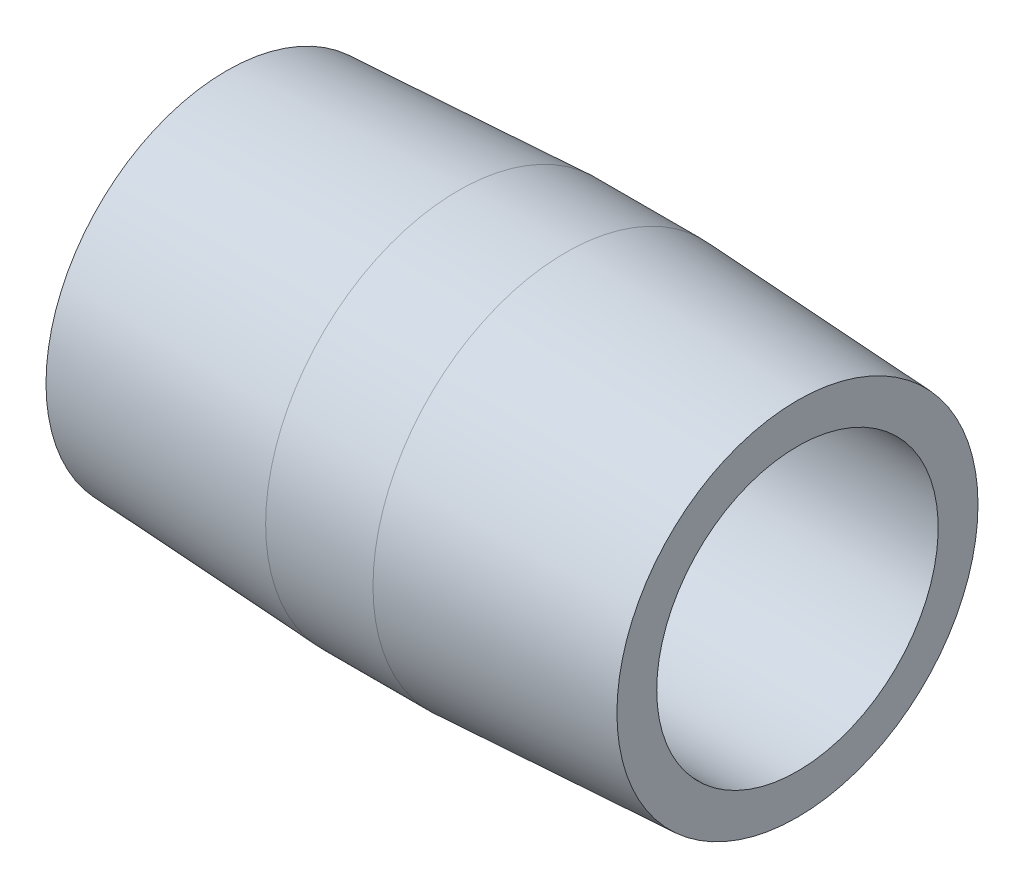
ISO-10303-21;
HEADER;
FILE_DESCRIPTION(('STEP AP214'),'2;1');
FILE_NAME('part.step','',(''),(''),'','','');
FILE_SCHEMA(('AUTOMOTIVE_DESIGN { 1 0 10303 214 1 1 1 1 }'));
ENDSEC;
DATA;
#1=APPLICATION_CONTEXT('core data for automotive mechanical design processes');
#2=APPLICATION_PROTOCOL_DEFINITION('international standard','automotive_design',2000,#1);
#3=PRODUCT_CONTEXT('',#1,'mechanical');
#4=PRODUCT('Part','Part','',(#3));
#5=PRODUCT_RELATED_PRODUCT_CATEGORY('part','',(#4));
#6=PRODUCT_DEFINITION_FORMATION('','',#4);
#7=PRODUCT_DEFINITION_CONTEXT('part definition',#1,'design');
#8=PRODUCT_DEFINITION('design','',#6,#7);
#9=PRODUCT_DEFINITION_SHAPE('','',#8);
#10=(LENGTH_UNIT() NAMED_UNIT(*) SI_UNIT(.MILLI.,.METRE.));
#11=(NAMED_UNIT(*) PLANE_ANGLE_UNIT() SI_UNIT($,.RADIAN.));
#12=(NAMED_UNIT(*) SI_UNIT($,.STERADIAN.) SOLID_ANGLE_UNIT());
#13=UNCERTAINTY_MEASURE_WITH_UNIT(LENGTH_MEASURE(1.E-05),#10,'distance_accuracy_value','');
#14=(GEOMETRIC_REPRESENTATION_CONTEXT(3) GLOBAL_UNCERTAINTY_ASSIGNED_CONTEXT((#13)) GLOBAL_UNIT_ASSIGNED_CONTEXT((#10,
#11,#12)) REPRESENTATION_CONTEXT('',''));
#15=CARTESIAN_POINT('',(0.,0.,0.));
#16=DIRECTION('',(0.,0.,1.));
#17=DIRECTION('',(1.,0.,0.));
#18=AXIS2_PLACEMENT_3D('',#15,#16,#17);
#19=CARTESIAN_POINT('',(25.4,6.26110000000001,0.));
#20=DIRECTION('',(-1.,0.,0.));
#21=DIRECTION('',(0.,0.,1.));
#22=AXIS2_PLACEMENT_3D('',#19,#20,#21);
#23=PLANE('',#22);
#24=CARTESIAN_POINT('',(25.4,0.,0.));
#25=DIRECTION('',(-1.,0.,0.));
#26=DIRECTION('',(0.,0.,1.));
#27=AXIS2_PLACEMENT_3D('',#24,#25,#26);
#28=CIRCLE('',#27,8.03205001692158);
#29=CARTESIAN_POINT('',(25.4,0.,8.03205001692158));
#30=VERTEX_POINT('',#29);
#31=EDGE_CURVE('E10',#30,#30,#28,.T.);
#32=ORIENTED_EDGE('',*,*,#31,.F.);
#33=EDGE_LOOP('',(#32));
#34=FACE_BOUND('',#33,.T.);
#35=CARTESIAN_POINT('',(25.4,0.,0.));
#36=DIRECTION('',(-1.,0.,0.));
#37=DIRECTION('',(0.,0.,1.));
#38=AXIS2_PLACEMENT_3D('',#35,#36,#37);
#39=CIRCLE('',#38,6.26110000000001);
#40=CARTESIAN_POINT('',(25.4,0.,6.26110000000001));
#41=VERTEX_POINT('',#40);
#42=EDGE_CURVE('E52',#41,#41,#39,.T.);
#43=ORIENTED_EDGE('',*,*,#42,.T.);
#44=EDGE_LOOP('',(#43));
#45=FACE_BOUND('',#44,.T.);
#46=ADVANCED_FACE('F30',(#34,#45),#23,.F.);
#47=CARTESIAN_POINT('',(25.4,0.,0.));
#48=DIRECTION('',(-1.,0.,0.));
#49=DIRECTION('',(0.,0.,1.));
#50=AXIS2_PLACEMENT_3D('',#47,#48,#49);
#51=CONICAL_SURFACE('',#50,8.03205001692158,0.0523598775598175);
#52=CARTESIAN_POINT('',(15.0876,0.,0.));
#53=DIRECTION('',(-1.,0.,0.));
#54=DIRECTION('',(0.,0.,1.));
#55=AXIS2_PLACEMENT_3D('',#52,#53,#54);
#56=CIRCLE('',#55,8.57249999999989);
#57=CARTESIAN_POINT('',(15.0876,0.,8.57249999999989));
#58=VERTEX_POINT('',#57);
#59=EDGE_CURVE('E36',#58,#58,#56,.T.);
#60=ORIENTED_EDGE('',*,*,#59,.F.);
#61=EDGE_LOOP('',(#60));
#62=FACE_BOUND('',#61,.T.);
#63=ORIENTED_EDGE('',*,*,#31,.T.);
#64=EDGE_LOOP('',(#63));
#65=FACE_BOUND('',#64,.T.);
#66=ADVANCED_FACE('F77',(#62,#65),#51,.T.);
#67=CARTESIAN_POINT('',(0.,0.,0.));
#68=DIRECTION('',(-1.,0.,0.));
#69=DIRECTION('',(0.,0.,1.));
#70=AXIS2_PLACEMENT_3D('',#67,#68,#69);
#71=CYLINDRICAL_SURFACE('',#70,8.57249999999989);
#72=CARTESIAN_POINT('',(10.3124,0.,0.));
#73=DIRECTION('',(-1.,0.,0.));
#74=DIRECTION('',(0.,0.,1.));
#75=AXIS2_PLACEMENT_3D('',#72,#73,#74);
#76=CIRCLE('',#75,8.57249999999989);
#77=CARTESIAN_POINT('',(10.3124,0.,8.57249999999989));
#78=VERTEX_POINT('',#77);
#79=EDGE_CURVE('E40',#78,#78,#76,.T.);
#80=ORIENTED_EDGE('',*,*,#79,.F.);
#81=EDGE_LOOP('',(#80));
#82=FACE_BOUND('',#81,.T.);
#83=ORIENTED_EDGE('',*,*,#59,.T.);
#84=EDGE_LOOP('',(#83));
#85=FACE_BOUND('',#84,.T.);
#86=ADVANCED_FACE('F72',(#82,#85),#71,.T.);
#87=CARTESIAN_POINT('',(10.3124,0.,0.));
#88=DIRECTION('',(1.,0.,0.));
#89=DIRECTION('',(0.,0.,-1.));
#90=AXIS2_PLACEMENT_3D('',#87,#88,#89);
#91=CONICAL_SURFACE('',#90,8.57249999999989,0.0523598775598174);
#92=CARTESIAN_POINT('',(0.,0.,0.));
#93=DIRECTION('',(-1.,0.,0.));
#94=DIRECTION('',(0.,0.,1.));
#95=AXIS2_PLACEMENT_3D('',#92,#93,#94);
#96=CIRCLE('',#95,8.03205001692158);
#97=CARTESIAN_POINT('',(0.,0.,8.03205001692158));
#98=VERTEX_POINT('',#97);
#99=EDGE_CURVE('E44',#98,#98,#96,.T.);
#100=ORIENTED_EDGE('',*,*,#99,.F.);
#101=EDGE_LOOP('',(#100));
#102=FACE_BOUND('',#101,.T.);
#103=ORIENTED_EDGE('',*,*,#79,.T.);
#104=EDGE_LOOP('',(#103));
#105=FACE_BOUND('',#104,.T.);
#106=ADVANCED_FACE('F66',(#102,#105),#91,.T.);
#107=CARTESIAN_POINT('',(0.,6.26110000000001,0.));
#108=DIRECTION('',(1.,0.,0.));
#109=DIRECTION('',(0.,0.,-1.));
#110=AXIS2_PLACEMENT_3D('',#107,#108,#109);
#111=PLANE('',#110);
#112=CARTESIAN_POINT('',(0.,0.,0.));
#113=DIRECTION('',(-1.,0.,0.));
#114=DIRECTION('',(0.,0.,1.));
#115=AXIS2_PLACEMENT_3D('',#112,#113,#114);
#116=CIRCLE('',#115,6.26110000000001);
#117=CARTESIAN_POINT('',(0.,0.,6.26110000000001));
#118=VERTEX_POINT('',#117);
#119=EDGE_CURVE('E49',#118,#118,#116,.T.);
#120=ORIENTED_EDGE('',*,*,#119,.F.);
#121=EDGE_LOOP('',(#120));
#122=FACE_BOUND('',#121,.T.);
#123=ORIENTED_EDGE('',*,*,#99,.T.);
#124=EDGE_LOOP('',(#123));
#125=FACE_BOUND('',#124,.T.);
#126=ADVANCED_FACE('F60',(#122,#125),#111,.F.);
#127=CARTESIAN_POINT('',(0.,0.,0.));
#128=DIRECTION('',(-1.,0.,0.));
#129=DIRECTION('',(0.,0.,1.));
#130=AXIS2_PLACEMENT_3D('',#127,#128,#129);
#131=CYLINDRICAL_SURFACE('',#130,6.26110000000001);
#132=ORIENTED_EDGE('',*,*,#42,.F.);
#133=EDGE_LOOP('',(#132));
#134=FACE_BOUND('',#133,.T.);
#135=ORIENTED_EDGE('',*,*,#119,.T.);
#136=EDGE_LOOP('',(#135));
#137=FACE_BOUND('',#136,.T.);
#138=ADVANCED_FACE('F57',(#134,#137),#131,.F.);
#139=CLOSED_SHELL('',(#46,#66,#86,#106,#126,#138));
#140=MANIFOLD_SOLID_BREP('B2',#139);
#141=ADVANCED_BREP_SHAPE_REPRESENTATION('',(#18,#140),#14);
#142=SHAPE_DEFINITION_REPRESENTATION(#9,#141);
ENDSEC;
END-ISO-10303-21;
